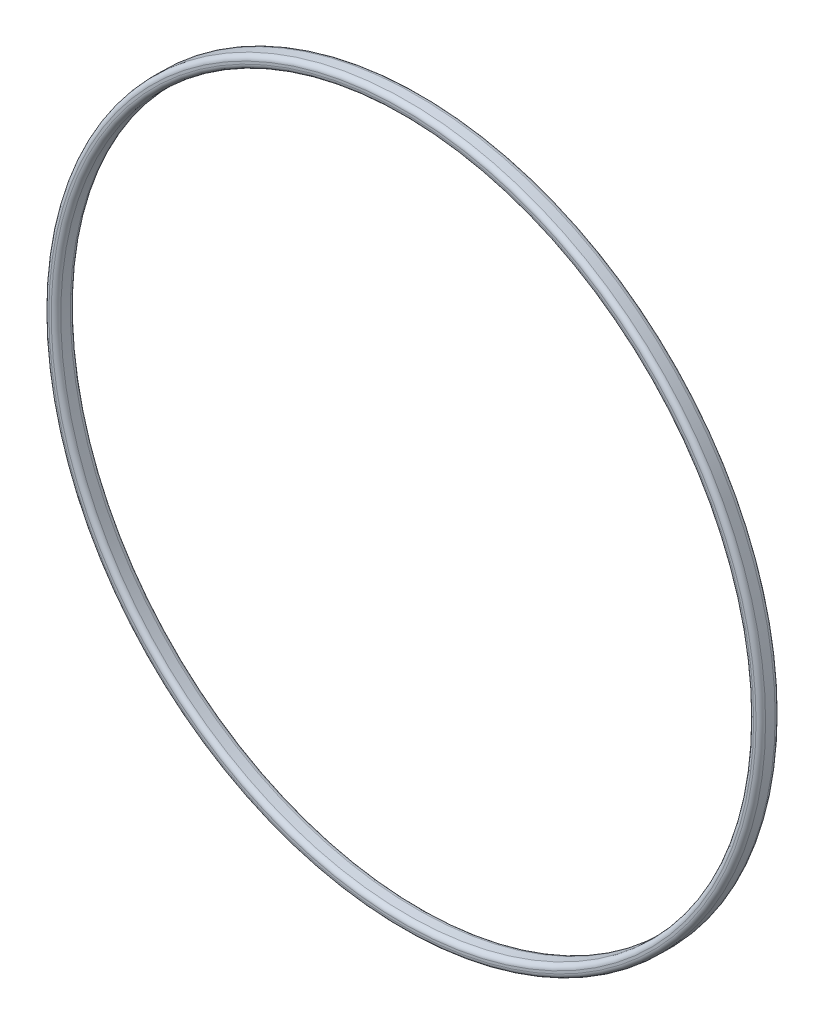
ISO-10303-21;
HEADER;
FILE_DESCRIPTION(('STEP AP214'),'2;1');
FILE_NAME('part.step','',(''),(''),'','','');
FILE_SCHEMA(('AUTOMOTIVE_DESIGN { 1 0 10303 214 1 1 1 1 }'));
ENDSEC;
DATA;
#1=APPLICATION_CONTEXT('core data for automotive mechanical design processes');
#2=APPLICATION_PROTOCOL_DEFINITION('international standard','automotive_design',2000,#1);
#3=PRODUCT_CONTEXT('',#1,'mechanical');
#4=PRODUCT('Part','Part','',(#3));
#5=PRODUCT_RELATED_PRODUCT_CATEGORY('part','',(#4));
#6=PRODUCT_DEFINITION_FORMATION('','',#4);
#7=PRODUCT_DEFINITION_CONTEXT('part definition',#1,'design');
#8=PRODUCT_DEFINITION('design','',#6,#7);
#9=PRODUCT_DEFINITION_SHAPE('','',#8);
#10=(LENGTH_UNIT() NAMED_UNIT(*) SI_UNIT(.MILLI.,.METRE.));
#11=(NAMED_UNIT(*) PLANE_ANGLE_UNIT() SI_UNIT($,.RADIAN.));
#12=(NAMED_UNIT(*) SI_UNIT($,.STERADIAN.) SOLID_ANGLE_UNIT());
#13=UNCERTAINTY_MEASURE_WITH_UNIT(LENGTH_MEASURE(1.E-05),#10,'distance_accuracy_value','');
#14=(GEOMETRIC_REPRESENTATION_CONTEXT(3) GLOBAL_UNCERTAINTY_ASSIGNED_CONTEXT((#13)) GLOBAL_UNIT_ASSIGNED_CONTEXT((#10,
#11,#12)) REPRESENTATION_CONTEXT('',''));
#15=CARTESIAN_POINT('',(0.,0.,0.));
#16=DIRECTION('',(0.,0.,1.));
#17=DIRECTION('',(1.,0.,0.));
#18=AXIS2_PLACEMENT_3D('',#15,#16,#17);
#19=CARTESIAN_POINT('',(0.,0.,-3.45936170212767));
#20=DIRECTION('',(0.,0.,1.));
#21=DIRECTION('',(1.,0.,0.));
#22=AXIS2_PLACEMENT_3D('',#19,#20,#21);
#23=TOROIDAL_SURFACE('',#22,73.5,1.);
#24=CARTESIAN_POINT('',(0.,0.,-4.45936170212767));
#25=DIRECTION('',(0.,0.,1.));
#26=DIRECTION('',(1.,0.,0.));
#27=AXIS2_PLACEMENT_3D('',#24,#25,#26);
#28=CIRCLE('',#27,73.5);
#29=CARTESIAN_POINT('',(73.5,0.,-4.45936170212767));
#30=VERTEX_POINT('',#29);
#31=EDGE_CURVE('E10',#30,#30,#28,.T.);
#32=ORIENTED_EDGE('',*,*,#31,.F.);
#33=EDGE_LOOP('',(#32));
#34=FACE_BOUND('',#33,.T.);
#35=CARTESIAN_POINT('',(0.,0.,-3.45936170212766));
#36=DIRECTION('',(0.,0.,1.));
#37=DIRECTION('',(1.,0.,0.));
#38=AXIS2_PLACEMENT_3D('',#35,#36,#37);
#39=CIRCLE('',#38,72.5);
#40=CARTESIAN_POINT('',(72.5,0.,-3.45936170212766));
#41=VERTEX_POINT('',#40);
#42=EDGE_CURVE('E56',#41,#41,#39,.T.);
#43=ORIENTED_EDGE('',*,*,#42,.T.);
#44=EDGE_LOOP('',(#43));
#45=FACE_BOUND('',#44,.T.);
#46=ADVANCED_FACE('F28',(#34,#45),#23,.T.);
#47=CARTESIAN_POINT('',(0.,74.,-4.45936170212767));
#48=DIRECTION('',(0.,0.,1.));
#49=DIRECTION('',(1.,0.,0.));
#50=AXIS2_PLACEMENT_3D('',#47,#48,#49);
#51=PLANE('',#50);
#52=CARTESIAN_POINT('',(0.,0.,-4.45936170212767));
#53=DIRECTION('',(0.,0.,1.));
#54=DIRECTION('',(1.,0.,0.));
#55=AXIS2_PLACEMENT_3D('',#52,#53,#54);
#56=CIRCLE('',#55,74.);
#57=CARTESIAN_POINT('',(74.,0.,-4.45936170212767));
#58=VERTEX_POINT('',#57);
#59=EDGE_CURVE('E34',#58,#58,#56,.T.);
#60=ORIENTED_EDGE('',*,*,#59,.F.);
#61=EDGE_LOOP('',(#60));
#62=FACE_BOUND('',#61,.T.);
#63=ORIENTED_EDGE('',*,*,#31,.T.);
#64=EDGE_LOOP('',(#63));
#65=FACE_BOUND('',#64,.T.);
#66=ADVANCED_FACE('F93',(#62,#65),#51,.F.);
#67=CARTESIAN_POINT('',(0.,0.,-3.45936170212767));
#68=DIRECTION('',(0.,0.,1.));
#69=DIRECTION('',(1.,0.,0.));
#70=AXIS2_PLACEMENT_3D('',#67,#68,#69);
#71=TOROIDAL_SURFACE('',#70,74.,1.);
#72=CARTESIAN_POINT('',(0.,0.,-3.45936170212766));
#73=DIRECTION('',(0.,0.,1.));
#74=DIRECTION('',(1.,0.,0.));
#75=AXIS2_PLACEMENT_3D('',#72,#73,#74);
#76=CIRCLE('',#75,75.);
#77=CARTESIAN_POINT('',(75.,0.,-3.45936170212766));
#78=VERTEX_POINT('',#77);
#79=EDGE_CURVE('E38',#78,#78,#76,.T.);
#80=ORIENTED_EDGE('',*,*,#79,.F.);
#81=EDGE_LOOP('',(#80));
#82=FACE_BOUND('',#81,.T.);
#83=ORIENTED_EDGE('',*,*,#59,.T.);
#84=EDGE_LOOP('',(#83));
#85=FACE_BOUND('',#84,.T.);
#86=ADVANCED_FACE('F88',(#82,#85),#71,.T.);
#87=CARTESIAN_POINT('',(0.,0.,20.8243971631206));
#88=DIRECTION('',(0.,0.,1.));
#89=DIRECTION('',(1.,0.,0.));
#90=AXIS2_PLACEMENT_3D('',#87,#88,#89);
#91=CYLINDRICAL_SURFACE('',#90,75.);
#92=CARTESIAN_POINT('',(0.,0.,-1.45936170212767));
#93=DIRECTION('',(0.,0.,1.));
#94=DIRECTION('',(1.,0.,0.));
#95=AXIS2_PLACEMENT_3D('',#92,#93,#94);
#96=CIRCLE('',#95,75.);
#97=CARTESIAN_POINT('',(75.,0.,-1.45936170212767));
#98=VERTEX_POINT('',#97);
#99=EDGE_CURVE('E42',#98,#98,#96,.T.);
#100=ORIENTED_EDGE('',*,*,#99,.F.);
#101=EDGE_LOOP('',(#100));
#102=FACE_BOUND('',#101,.T.);
#103=ORIENTED_EDGE('',*,*,#79,.T.);
#104=EDGE_LOOP('',(#103));
#105=FACE_BOUND('',#104,.T.);
#106=ADVANCED_FACE('F82',(#102,#105),#91,.T.);
#107=CARTESIAN_POINT('',(0.,0.,-1.45936170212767));
#108=DIRECTION('',(0.,0.,1.));
#109=DIRECTION('',(1.,0.,0.));
#110=AXIS2_PLACEMENT_3D('',#107,#108,#109);
#111=TOROIDAL_SURFACE('',#110,74.,1.);
#112=CARTESIAN_POINT('',(0.,0.,-0.459361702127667));
#113=DIRECTION('',(0.,0.,1.));
#114=DIRECTION('',(1.,0.,0.));
#115=AXIS2_PLACEMENT_3D('',#112,#113,#114);
#116=CIRCLE('',#115,74.);
#117=CARTESIAN_POINT('',(74.,0.,-0.459361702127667));
#118=VERTEX_POINT('',#117);
#119=EDGE_CURVE('E47',#118,#118,#116,.T.);
#120=ORIENTED_EDGE('',*,*,#119,.F.);
#121=EDGE_LOOP('',(#120));
#122=FACE_BOUND('',#121,.T.);
#123=ORIENTED_EDGE('',*,*,#99,.T.);
#124=EDGE_LOOP('',(#123));
#125=FACE_BOUND('',#124,.T.);
#126=ADVANCED_FACE('F76',(#122,#125),#111,.T.);
#127=CARTESIAN_POINT('',(0.,74.,-0.459361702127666));
#128=DIRECTION('',(0.,0.,-1.));
#129=DIRECTION('',(-1.,0.,0.));
#130=AXIS2_PLACEMENT_3D('',#127,#128,#129);
#131=PLANE('',#130);
#132=CARTESIAN_POINT('',(0.,0.,-0.459361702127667));
#133=DIRECTION('',(0.,0.,1.));
#134=DIRECTION('',(1.,0.,0.));
#135=AXIS2_PLACEMENT_3D('',#132,#133,#134);
#136=CIRCLE('',#135,73.5);
#137=CARTESIAN_POINT('',(73.5,0.,-0.459361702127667));
#138=VERTEX_POINT('',#137);
#139=EDGE_CURVE('E50',#138,#138,#136,.T.);
#140=ORIENTED_EDGE('',*,*,#139,.F.);
#141=EDGE_LOOP('',(#140));
#142=FACE_BOUND('',#141,.T.);
#143=ORIENTED_EDGE('',*,*,#119,.T.);
#144=EDGE_LOOP('',(#143));
#145=FACE_BOUND('',#144,.T.);
#146=ADVANCED_FACE('F70',(#142,#145),#131,.F.);
#147=CARTESIAN_POINT('',(0.,0.,-1.45936170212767));
#148=DIRECTION('',(0.,0.,1.));
#149=DIRECTION('',(1.,0.,0.));
#150=AXIS2_PLACEMENT_3D('',#147,#148,#149);
#151=TOROIDAL_SURFACE('',#150,73.5,1.);
#152=CARTESIAN_POINT('',(0.,0.,-1.45936170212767));
#153=DIRECTION('',(0.,0.,1.));
#154=DIRECTION('',(1.,0.,0.));
#155=AXIS2_PLACEMENT_3D('',#152,#153,#154);
#156=CIRCLE('',#155,72.5);
#157=CARTESIAN_POINT('',(72.5,0.,-1.45936170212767));
#158=VERTEX_POINT('',#157);
#159=EDGE_CURVE('E53',#158,#158,#156,.T.);
#160=ORIENTED_EDGE('',*,*,#159,.F.);
#161=EDGE_LOOP('',(#160));
#162=FACE_BOUND('',#161,.T.);
#163=ORIENTED_EDGE('',*,*,#139,.T.);
#164=EDGE_LOOP('',(#163));
#165=FACE_BOUND('',#164,.T.);
#166=ADVANCED_FACE('F64',(#162,#165),#151,.T.);
#167=CARTESIAN_POINT('',(0.,0.,20.8243971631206));
#168=DIRECTION('',(0.,0.,1.));
#169=DIRECTION('',(1.,0.,0.));
#170=AXIS2_PLACEMENT_3D('',#167,#168,#169);
#171=CYLINDRICAL_SURFACE('',#170,72.5);
#172=ORIENTED_EDGE('',*,*,#42,.F.);
#173=EDGE_LOOP('',(#172));
#174=FACE_BOUND('',#173,.T.);
#175=ORIENTED_EDGE('',*,*,#159,.T.);
#176=EDGE_LOOP('',(#175));
#177=FACE_BOUND('',#176,.T.);
#178=ADVANCED_FACE('F61',(#174,#177),#171,.F.);
#179=CLOSED_SHELL('',(#46,#66,#86,#106,#126,#146,#166,#178));
#180=MANIFOLD_SOLID_BREP('B2',#179);
#181=ADVANCED_BREP_SHAPE_REPRESENTATION('',(#18,#180),#14);
#182=SHAPE_DEFINITION_REPRESENTATION(#9,#181);
ENDSEC;
END-ISO-10303-21;
